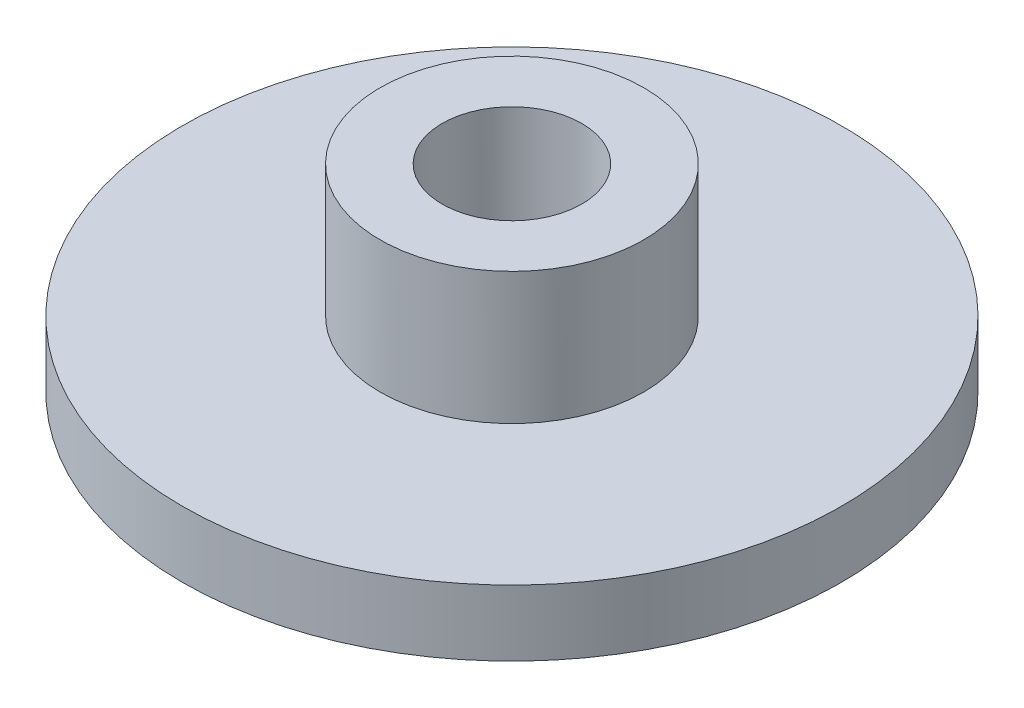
from build123d import *

# Parameters (mm, degrees)
SKETCH1_R      = 63.5
SKETCH1_R_2    = 13.462
EXTRUDE1_DEPTH = 12.7
SKETCH2_R      = 25.4
SKETCH2_R_2    = 13.462
EXTRUDE2_DEPTH = 25.4


with BuildPart() as part:
    # Sketch1 → Extrude1 (new body)
    with BuildSketch(Plane(origin=(0, 0, 0), x_dir=(1, 0, 0), z_dir=(0, 1, 0))):
        with Locations(Location((0, 0, 0), (0, 0, 270))):
            Circle(SKETCH1_R)
        with Locations(Location((0, 0, 0), (0, 0, 270))):
            Circle(SKETCH1_R_2, mode=Mode.SUBTRACT)
    extrude(amount=EXTRUDE1_DEPTH)

    # Sketch2 → Extrude2 (add)
    with BuildSketch(Plane.XZ.offset(-12.7)):
        with Locations(Location((0, 0, 0), (0, 0, 270))):
            Circle(SKETCH2_R)
        with Locations(Location((0, 0, 0), (0, 0, 270))):
            Circle(SKETCH2_R_2, mode=Mode.SUBTRACT)
    extrude(amount=-EXTRUDE2_DEPTH)


solid = part.part
